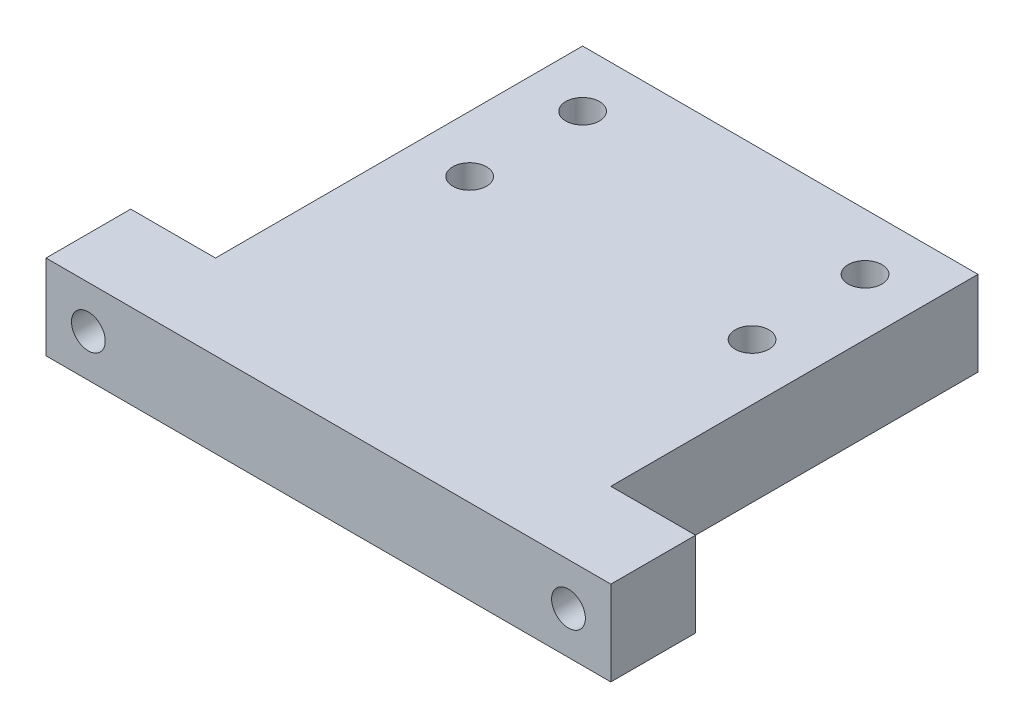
ISO-10303-21;
HEADER;
FILE_DESCRIPTION(('STEP AP214'),'2;1');
FILE_NAME('part.step','',(''),(''),'','','');
FILE_SCHEMA(('AUTOMOTIVE_DESIGN { 1 0 10303 214 1 1 1 1 }'));
ENDSEC;
DATA;
#1=APPLICATION_CONTEXT('core data for automotive mechanical design processes');
#2=APPLICATION_PROTOCOL_DEFINITION('international standard','automotive_design',2000,#1);
#3=PRODUCT_CONTEXT('',#1,'mechanical');
#4=PRODUCT('Part','Part','',(#3));
#5=PRODUCT_RELATED_PRODUCT_CATEGORY('part','',(#4));
#6=PRODUCT_DEFINITION_FORMATION('','',#4);
#7=PRODUCT_DEFINITION_CONTEXT('part definition',#1,'design');
#8=PRODUCT_DEFINITION('design','',#6,#7);
#9=PRODUCT_DEFINITION_SHAPE('','',#8);
#10=(LENGTH_UNIT() NAMED_UNIT(*) SI_UNIT(.MILLI.,.METRE.));
#11=(NAMED_UNIT(*) PLANE_ANGLE_UNIT() SI_UNIT($,.RADIAN.));
#12=(NAMED_UNIT(*) SI_UNIT($,.STERADIAN.) SOLID_ANGLE_UNIT());
#13=UNCERTAINTY_MEASURE_WITH_UNIT(LENGTH_MEASURE(1.E-05),#10,'distance_accuracy_value','');
#14=(GEOMETRIC_REPRESENTATION_CONTEXT(3) GLOBAL_UNCERTAINTY_ASSIGNED_CONTEXT((#13)) GLOBAL_UNIT_ASSIGNED_CONTEXT((#10,
#11,#12)) REPRESENTATION_CONTEXT('',''));
#15=CARTESIAN_POINT('',(0.,0.,0.));
#16=DIRECTION('',(0.,0.,1.));
#17=DIRECTION('',(1.,0.,0.));
#18=AXIS2_PLACEMENT_3D('',#15,#16,#17);
#19=CARTESIAN_POINT('',(-31.75,-4.7625,0.));
#20=DIRECTION('',(0.,-1.,0.));
#21=DIRECTION('',(0.,0.,-1.));
#22=AXIS2_PLACEMENT_3D('',#19,#20,#21);
#23=PLANE('',#22);
#24=CARTESIAN_POINT('',(-15.875,-4.7625,-44.45));
#25=DIRECTION('',(0.,1.,0.));
#26=DIRECTION('',(0.,0.,1.));
#27=AXIS2_PLACEMENT_3D('',#24,#25,#26);
#28=CIRCLE('',#27,1.89865);
#29=CARTESIAN_POINT('',(-15.875,-4.7625,-42.55135));
#30=VERTEX_POINT('',#29);
#31=EDGE_CURVE('E235',#30,#30,#28,.T.);
#32=ORIENTED_EDGE('',*,*,#31,.T.);
#33=EDGE_LOOP('',(#32));
#34=FACE_BOUND('',#33,.T.);
#35=CARTESIAN_POINT('',(-15.875,-4.7625,-31.75));
#36=DIRECTION('',(0.,1.,0.));
#37=DIRECTION('',(0.,0.,1.));
#38=AXIS2_PLACEMENT_3D('',#35,#36,#37);
#39=CIRCLE('',#38,1.89865);
#40=CARTESIAN_POINT('',(-15.875,-4.7625,-29.85135));
#41=VERTEX_POINT('',#40);
#42=EDGE_CURVE('E249',#41,#41,#39,.T.);
#43=ORIENTED_EDGE('',*,*,#42,.T.);
#44=EDGE_LOOP('',(#43));
#45=FACE_BOUND('',#44,.T.);
#46=DIRECTION('',(0.,0.,1.));
#47=VECTOR('',#46,1.);
#48=CARTESIAN_POINT('',(-31.75,-4.7625,0.));
#49=LINE('',#48,#47);
#50=CARTESIAN_POINT('',(-31.75,-4.7625,-9.525));
#51=VERTEX_POINT('',#50);
#52=CARTESIAN_POINT('',(-31.75,-4.7625,0.));
#53=VERTEX_POINT('',#52);
#54=EDGE_CURVE('E98',#51,#53,#49,.T.);
#55=ORIENTED_EDGE('',*,*,#54,.F.);
#56=DIRECTION('',(-1.,0.,0.));
#57=VECTOR('',#56,1.);
#58=CARTESIAN_POINT('',(-31.75,-4.7625,-9.525));
#59=LINE('',#58,#57);
#60=CARTESIAN_POINT('',(-22.225,-4.7625,-9.52499999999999));
#61=VERTEX_POINT('',#60);
#62=EDGE_CURVE('E128',#61,#51,#59,.T.);
#63=ORIENTED_EDGE('',*,*,#62,.F.);
#64=DIRECTION('',(0.,0.,1.));
#65=VECTOR('',#64,1.);
#66=CARTESIAN_POINT('',(-22.225,-4.7625,-50.8));
#67=LINE('',#66,#65);
#68=CARTESIAN_POINT('',(-22.225,-4.7625,-50.8));
#69=VERTEX_POINT('',#68);
#70=EDGE_CURVE('E126',#69,#61,#67,.T.);
#71=ORIENTED_EDGE('',*,*,#70,.F.);
#72=DIRECTION('',(-1.,0.,0.));
#73=VECTOR('',#72,1.);
#74=CARTESIAN_POINT('',(-22.225,-4.7625,-50.8));
#75=LINE('',#74,#73);
#76=CARTESIAN_POINT('',(22.225,-4.7625,-50.8));
#77=VERTEX_POINT('',#76);
#78=EDGE_CURVE('E124',#77,#69,#75,.T.);
#79=ORIENTED_EDGE('',*,*,#78,.F.);
#80=DIRECTION('',(0.,0.,-1.));
#81=VECTOR('',#80,1.);
#82=CARTESIAN_POINT('',(22.225,-4.7625,-50.8));
#83=LINE('',#82,#81);
#84=CARTESIAN_POINT('',(22.225,-4.7625,-9.525));
#85=VERTEX_POINT('',#84);
#86=EDGE_CURVE('E122',#85,#77,#83,.T.);
#87=ORIENTED_EDGE('',*,*,#86,.F.);
#88=DIRECTION('',(-1.,0.,0.));
#89=VECTOR('',#88,1.);
#90=CARTESIAN_POINT('',(31.75,-4.7625,-9.525));
#91=LINE('',#90,#89);
#92=CARTESIAN_POINT('',(31.75,-4.7625,-9.525));
#93=VERTEX_POINT('',#92);
#94=EDGE_CURVE('E120',#93,#85,#91,.T.);
#95=ORIENTED_EDGE('',*,*,#94,.F.);
#96=DIRECTION('',(0.,0.,-1.));
#97=VECTOR('',#96,1.);
#98=CARTESIAN_POINT('',(31.75,-4.7625,0.));
#99=LINE('',#98,#97);
#100=CARTESIAN_POINT('',(31.75,-4.7625,0.));
#101=VERTEX_POINT('',#100);
#102=EDGE_CURVE('E100',#101,#93,#99,.T.);
#103=ORIENTED_EDGE('',*,*,#102,.F.);
#104=DIRECTION('',(1.,0.,0.));
#105=VECTOR('',#104,1.);
#106=CARTESIAN_POINT('',(-31.75,-4.7625,0.));
#107=LINE('',#106,#105);
#108=EDGE_CURVE('E94',#53,#101,#107,.T.);
#109=ORIENTED_EDGE('',*,*,#108,.F.);
#110=EDGE_LOOP('',(#55,#63,#71,#79,#87,#95,#103,#109));
#111=FACE_BOUND('',#110,.T.);
#112=CARTESIAN_POINT('',(15.875,-4.7625,-31.75));
#113=DIRECTION('',(0.,1.,0.));
#114=DIRECTION('',(0.,0.,1.));
#115=AXIS2_PLACEMENT_3D('',#112,#113,#114);
#116=CIRCLE('',#115,1.89865);
#117=CARTESIAN_POINT('',(15.875,-4.7625,-29.85135));
#118=VERTEX_POINT('',#117);
#119=EDGE_CURVE('E243',#118,#118,#116,.T.);
#120=ORIENTED_EDGE('',*,*,#119,.T.);
#121=EDGE_LOOP('',(#120));
#122=FACE_BOUND('',#121,.T.);
#123=CARTESIAN_POINT('',(15.875,-4.7625,-44.45));
#124=DIRECTION('',(0.,1.,0.));
#125=DIRECTION('',(0.,0.,1.));
#126=AXIS2_PLACEMENT_3D('',#123,#124,#125);
#127=CIRCLE('',#126,1.89865);
#128=CARTESIAN_POINT('',(15.875,-4.7625,-42.55135));
#129=VERTEX_POINT('',#128);
#130=EDGE_CURVE('E231',#129,#129,#127,.T.);
#131=ORIENTED_EDGE('',*,*,#130,.T.);
#132=EDGE_LOOP('',(#131));
#133=FACE_BOUND('',#132,.T.);
#134=ADVANCED_FACE('F29',(#34,#45,#111,#122,#133),#23,.T.);
#135=CARTESIAN_POINT('',(-31.75,4.7625,0.));
#136=DIRECTION('',(1.,0.,0.));
#137=DIRECTION('',(0.,0.,-1.));
#138=AXIS2_PLACEMENT_3D('',#135,#136,#137);
#139=PLANE('',#138);
#140=ORIENTED_EDGE('',*,*,#54,.T.);
#141=DIRECTION('',(0.,-1.,0.));
#142=VECTOR('',#141,1.);
#143=CARTESIAN_POINT('',(-31.75,4.7625,0.));
#144=LINE('',#143,#142);
#145=CARTESIAN_POINT('',(-31.75,4.7625,0.));
#146=VERTEX_POINT('',#145);
#147=EDGE_CURVE('E11',#146,#53,#144,.T.);
#148=ORIENTED_EDGE('',*,*,#147,.F.);
#149=DIRECTION('',(0.,0.,1.));
#150=VECTOR('',#149,1.);
#151=CARTESIAN_POINT('',(-31.75,4.7625,0.));
#152=LINE('',#151,#150);
#153=CARTESIAN_POINT('',(-31.75,4.7625,-9.525));
#154=VERTEX_POINT('',#153);
#155=EDGE_CURVE('E130',#154,#146,#152,.T.);
#156=ORIENTED_EDGE('',*,*,#155,.F.);
#157=DIRECTION('',(0.,-1.,0.));
#158=VECTOR('',#157,1.);
#159=CARTESIAN_POINT('',(-31.75,4.7625,-9.525));
#160=LINE('',#159,#158);
#161=EDGE_CURVE('E111',#154,#51,#160,.T.);
#162=ORIENTED_EDGE('',*,*,#161,.T.);
#163=EDGE_LOOP('',(#140,#148,#156,#162));
#164=FACE_BOUND('',#163,.T.);
#165=ADVANCED_FACE('F31',(#164),#139,.F.);
#166=CARTESIAN_POINT('',(-31.75,4.7625,0.));
#167=DIRECTION('',(0.,0.,-1.));
#168=DIRECTION('',(-1.,0.,0.));
#169=AXIS2_PLACEMENT_3D('',#166,#167,#168);
#170=PLANE('',#169);
#171=CARTESIAN_POINT('',(26.9875,0.,0.));
#172=DIRECTION('',(0.,0.,-1.));
#173=DIRECTION('',(-1.,0.,0.));
#174=AXIS2_PLACEMENT_3D('',#171,#172,#173);
#175=CIRCLE('',#174,1.89865);
#176=CARTESIAN_POINT('',(25.08885,0.,0.));
#177=VERTEX_POINT('',#176);
#178=EDGE_CURVE('E255',#177,#177,#175,.T.);
#179=ORIENTED_EDGE('',*,*,#178,.T.);
#180=EDGE_LOOP('',(#179));
#181=FACE_BOUND('',#180,.T.);
#182=CARTESIAN_POINT('',(-26.9875,0.,0.));
#183=DIRECTION('',(0.,0.,-1.));
#184=DIRECTION('',(-1.,0.,0.));
#185=AXIS2_PLACEMENT_3D('',#182,#183,#184);
#186=CIRCLE('',#185,1.89865);
#187=CARTESIAN_POINT('',(-28.88615,0.,0.));
#188=VERTEX_POINT('',#187);
#189=EDGE_CURVE('E115',#188,#188,#186,.T.);
#190=ORIENTED_EDGE('',*,*,#189,.T.);
#191=EDGE_LOOP('',(#190));
#192=FACE_BOUND('',#191,.T.);
#193=ORIENTED_EDGE('',*,*,#108,.T.);
#194=DIRECTION('',(0.,-1.,0.));
#195=VECTOR('',#194,1.);
#196=CARTESIAN_POINT('',(31.75,4.7625,0.));
#197=LINE('',#196,#195);
#198=CARTESIAN_POINT('',(31.75,4.7625,0.));
#199=VERTEX_POINT('',#198);
#200=EDGE_CURVE('E37',#199,#101,#197,.T.);
#201=ORIENTED_EDGE('',*,*,#200,.F.);
#202=DIRECTION('',(1.,0.,0.));
#203=VECTOR('',#202,1.);
#204=CARTESIAN_POINT('',(-31.75,4.7625,0.));
#205=LINE('',#204,#203);
#206=EDGE_CURVE('E107',#146,#199,#205,.T.);
#207=ORIENTED_EDGE('',*,*,#206,.F.);
#208=ORIENTED_EDGE('',*,*,#147,.T.);
#209=EDGE_LOOP('',(#193,#201,#207,#208));
#210=FACE_BOUND('',#209,.T.);
#211=ADVANCED_FACE('F106',(#181,#192,#210),#170,.F.);
#212=CARTESIAN_POINT('',(31.75,4.7625,0.));
#213=DIRECTION('',(-1.,0.,0.));
#214=DIRECTION('',(0.,0.,1.));
#215=AXIS2_PLACEMENT_3D('',#212,#213,#214);
#216=PLANE('',#215);
#217=ORIENTED_EDGE('',*,*,#102,.T.);
#218=DIRECTION('',(0.,-1.,0.));
#219=VECTOR('',#218,1.);
#220=CARTESIAN_POINT('',(31.75,4.7625,-9.525));
#221=LINE('',#220,#219);
#222=CARTESIAN_POINT('',(31.75,4.7625,-9.525));
#223=VERTEX_POINT('',#222);
#224=EDGE_CURVE('E156',#223,#93,#221,.T.);
#225=ORIENTED_EDGE('',*,*,#224,.F.);
#226=DIRECTION('',(0.,0.,-1.));
#227=VECTOR('',#226,1.);
#228=CARTESIAN_POINT('',(31.75,4.7625,0.));
#229=LINE('',#228,#227);
#230=EDGE_CURVE('E133',#199,#223,#229,.T.);
#231=ORIENTED_EDGE('',*,*,#230,.F.);
#232=ORIENTED_EDGE('',*,*,#200,.T.);
#233=EDGE_LOOP('',(#217,#225,#231,#232));
#234=FACE_BOUND('',#233,.T.);
#235=ADVANCED_FACE('F160',(#234),#216,.F.);
#236=CARTESIAN_POINT('',(31.75,4.7625,-9.525));
#237=DIRECTION('',(0.,0.,1.));
#238=DIRECTION('',(1.,0.,0.));
#239=AXIS2_PLACEMENT_3D('',#236,#237,#238);
#240=PLANE('',#239);
#241=CARTESIAN_POINT('',(26.9875,0.,-9.525));
#242=DIRECTION('',(0.,0.,-1.));
#243=DIRECTION('',(-1.,0.,0.));
#244=AXIS2_PLACEMENT_3D('',#241,#242,#243);
#245=CIRCLE('',#244,1.89864999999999);
#246=CARTESIAN_POINT('',(25.08885,0.,-9.525));
#247=VERTEX_POINT('',#246);
#248=EDGE_CURVE('E258',#247,#247,#245,.T.);
#249=ORIENTED_EDGE('',*,*,#248,.F.);
#250=EDGE_LOOP('',(#249));
#251=FACE_BOUND('',#250,.T.);
#252=ORIENTED_EDGE('',*,*,#94,.T.);
#253=DIRECTION('',(0.,-1.,0.));
#254=VECTOR('',#253,1.);
#255=CARTESIAN_POINT('',(22.225,4.7625,-9.525));
#256=LINE('',#255,#254);
#257=CARTESIAN_POINT('',(22.225,4.7625,-9.525));
#258=VERTEX_POINT('',#257);
#259=EDGE_CURVE('E153',#258,#85,#256,.T.);
#260=ORIENTED_EDGE('',*,*,#259,.F.);
#261=DIRECTION('',(-1.,0.,0.));
#262=VECTOR('',#261,1.);
#263=CARTESIAN_POINT('',(31.75,4.7625,-9.525));
#264=LINE('',#263,#262);
#265=EDGE_CURVE('E135',#223,#258,#264,.T.);
#266=ORIENTED_EDGE('',*,*,#265,.F.);
#267=ORIENTED_EDGE('',*,*,#224,.T.);
#268=EDGE_LOOP('',(#252,#260,#266,#267));
#269=FACE_BOUND('',#268,.T.);
#270=ADVANCED_FACE('F168',(#251,#269),#240,.F.);
#271=CARTESIAN_POINT('',(22.225,4.7625,-50.8));
#272=DIRECTION('',(-1.,0.,0.));
#273=DIRECTION('',(0.,0.,1.));
#274=AXIS2_PLACEMENT_3D('',#271,#272,#273);
#275=PLANE('',#274);
#276=ORIENTED_EDGE('',*,*,#86,.T.);
#277=DIRECTION('',(0.,-1.,0.));
#278=VECTOR('',#277,1.);
#279=CARTESIAN_POINT('',(22.225,4.7625,-50.8));
#280=LINE('',#279,#278);
#281=CARTESIAN_POINT('',(22.225,4.7625,-50.8));
#282=VERTEX_POINT('',#281);
#283=EDGE_CURVE('E150',#282,#77,#280,.T.);
#284=ORIENTED_EDGE('',*,*,#283,.F.);
#285=DIRECTION('',(0.,0.,-1.));
#286=VECTOR('',#285,1.);
#287=CARTESIAN_POINT('',(22.225,4.7625,-50.8));
#288=LINE('',#287,#286);
#289=EDGE_CURVE('E137',#258,#282,#288,.T.);
#290=ORIENTED_EDGE('',*,*,#289,.F.);
#291=ORIENTED_EDGE('',*,*,#259,.T.);
#292=EDGE_LOOP('',(#276,#284,#290,#291));
#293=FACE_BOUND('',#292,.T.);
#294=ADVANCED_FACE('F171',(#293),#275,.F.);
#295=CARTESIAN_POINT('',(-22.225,4.7625,-50.8));
#296=DIRECTION('',(0.,0.,1.));
#297=DIRECTION('',(1.,0.,0.));
#298=AXIS2_PLACEMENT_3D('',#295,#296,#297);
#299=PLANE('',#298);
#300=ORIENTED_EDGE('',*,*,#78,.T.);
#301=DIRECTION('',(0.,-1.,0.));
#302=VECTOR('',#301,1.);
#303=CARTESIAN_POINT('',(-22.225,4.7625,-50.8));
#304=LINE('',#303,#302);
#305=CARTESIAN_POINT('',(-22.225,4.7625,-50.8));
#306=VERTEX_POINT('',#305);
#307=EDGE_CURVE('E147',#306,#69,#304,.T.);
#308=ORIENTED_EDGE('',*,*,#307,.F.);
#309=DIRECTION('',(-1.,0.,0.));
#310=VECTOR('',#309,1.);
#311=CARTESIAN_POINT('',(-22.225,4.7625,-50.8));
#312=LINE('',#311,#310);
#313=EDGE_CURVE('E139',#282,#306,#312,.T.);
#314=ORIENTED_EDGE('',*,*,#313,.F.);
#315=ORIENTED_EDGE('',*,*,#283,.T.);
#316=EDGE_LOOP('',(#300,#308,#314,#315));
#317=FACE_BOUND('',#316,.T.);
#318=ADVANCED_FACE('F176',(#317),#299,.F.);
#319=CARTESIAN_POINT('',(-22.225,4.7625,-50.8));
#320=DIRECTION('',(1.,0.,0.));
#321=DIRECTION('',(0.,0.,-1.));
#322=AXIS2_PLACEMENT_3D('',#319,#320,#321);
#323=PLANE('',#322);
#324=ORIENTED_EDGE('',*,*,#70,.T.);
#325=DIRECTION('',(0.,-1.,0.));
#326=VECTOR('',#325,1.);
#327=CARTESIAN_POINT('',(-22.225,4.7625,-9.52499999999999));
#328=LINE('',#327,#326);
#329=CARTESIAN_POINT('',(-22.225,4.7625,-9.52499999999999));
#330=VERTEX_POINT('',#329);
#331=EDGE_CURVE('E144',#330,#61,#328,.T.);
#332=ORIENTED_EDGE('',*,*,#331,.F.);
#333=DIRECTION('',(0.,0.,1.));
#334=VECTOR('',#333,1.);
#335=CARTESIAN_POINT('',(-22.225,4.7625,-50.8));
#336=LINE('',#335,#334);
#337=EDGE_CURVE('E49',#306,#330,#336,.T.);
#338=ORIENTED_EDGE('',*,*,#337,.F.);
#339=ORIENTED_EDGE('',*,*,#307,.T.);
#340=EDGE_LOOP('',(#324,#332,#338,#339));
#341=FACE_BOUND('',#340,.T.);
#342=ADVANCED_FACE('F179',(#341),#323,.F.);
#343=CARTESIAN_POINT('',(-31.75,4.7625,-9.525));
#344=DIRECTION('',(0.,0.,1.));
#345=DIRECTION('',(1.,0.,0.));
#346=AXIS2_PLACEMENT_3D('',#343,#344,#345);
#347=PLANE('',#346);
#348=CARTESIAN_POINT('',(-26.9875,0.,-9.52499999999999));
#349=DIRECTION('',(0.,0.,-1.));
#350=DIRECTION('',(-1.,0.,0.));
#351=AXIS2_PLACEMENT_3D('',#348,#349,#350);
#352=CIRCLE('',#351,1.89864999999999);
#353=CARTESIAN_POINT('',(-28.88615,0.,-9.52499999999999));
#354=VERTEX_POINT('',#353);
#355=EDGE_CURVE('E112',#354,#354,#352,.T.);
#356=ORIENTED_EDGE('',*,*,#355,.F.);
#357=EDGE_LOOP('',(#356));
#358=FACE_BOUND('',#357,.T.);
#359=ORIENTED_EDGE('',*,*,#62,.T.);
#360=ORIENTED_EDGE('',*,*,#161,.F.);
#361=DIRECTION('',(-1.,0.,0.));
#362=VECTOR('',#361,1.);
#363=CARTESIAN_POINT('',(-31.75,4.7625,-9.525));
#364=LINE('',#363,#362);
#365=EDGE_CURVE('E44',#330,#154,#364,.T.);
#366=ORIENTED_EDGE('',*,*,#365,.F.);
#367=ORIENTED_EDGE('',*,*,#331,.T.);
#368=EDGE_LOOP('',(#359,#360,#366,#367));
#369=FACE_BOUND('',#368,.T.);
#370=ADVANCED_FACE('F181',(#358,#369),#347,.F.);
#371=CARTESIAN_POINT('',(-31.75,4.7625,0.));
#372=DIRECTION('',(0.,-1.,0.));
#373=DIRECTION('',(0.,0.,-1.));
#374=AXIS2_PLACEMENT_3D('',#371,#372,#373);
#375=PLANE('',#374);
#376=CARTESIAN_POINT('',(15.875,4.7625,-44.45));
#377=DIRECTION('',(0.,1.,0.));
#378=DIRECTION('',(0.,0.,1.));
#379=AXIS2_PLACEMENT_3D('',#376,#377,#378);
#380=CIRCLE('',#379,1.89864999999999);
#381=CARTESIAN_POINT('',(15.875,4.7625,-42.55135));
#382=VERTEX_POINT('',#381);
#383=EDGE_CURVE('E234',#382,#382,#380,.T.);
#384=ORIENTED_EDGE('',*,*,#383,.F.);
#385=EDGE_LOOP('',(#384));
#386=FACE_BOUND('',#385,.T.);
#387=CARTESIAN_POINT('',(-15.875,4.7625,-44.45));
#388=DIRECTION('',(0.,1.,0.));
#389=DIRECTION('',(0.,0.,1.));
#390=AXIS2_PLACEMENT_3D('',#387,#388,#389);
#391=CIRCLE('',#390,1.89864999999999);
#392=CARTESIAN_POINT('',(-15.875,4.7625,-42.55135));
#393=VERTEX_POINT('',#392);
#394=EDGE_CURVE('E237',#393,#393,#391,.T.);
#395=ORIENTED_EDGE('',*,*,#394,.F.);
#396=EDGE_LOOP('',(#395));
#397=FACE_BOUND('',#396,.T.);
#398=CARTESIAN_POINT('',(15.875,4.7625,-31.75));
#399=DIRECTION('',(0.,1.,0.));
#400=DIRECTION('',(0.,0.,1.));
#401=AXIS2_PLACEMENT_3D('',#398,#399,#400);
#402=CIRCLE('',#401,1.89864999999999);
#403=CARTESIAN_POINT('',(15.875,4.7625,-29.85135));
#404=VERTEX_POINT('',#403);
#405=EDGE_CURVE('E246',#404,#404,#402,.T.);
#406=ORIENTED_EDGE('',*,*,#405,.F.);
#407=EDGE_LOOP('',(#406));
#408=FACE_BOUND('',#407,.T.);
#409=CARTESIAN_POINT('',(-15.875,4.7625,-31.75));
#410=DIRECTION('',(0.,1.,0.));
#411=DIRECTION('',(0.,0.,1.));
#412=AXIS2_PLACEMENT_3D('',#409,#410,#411);
#413=CIRCLE('',#412,1.89864999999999);
#414=CARTESIAN_POINT('',(-15.875,4.7625,-29.85135));
#415=VERTEX_POINT('',#414);
#416=EDGE_CURVE('E252',#415,#415,#413,.T.);
#417=ORIENTED_EDGE('',*,*,#416,.F.);
#418=EDGE_LOOP('',(#417));
#419=FACE_BOUND('',#418,.T.);
#420=ORIENTED_EDGE('',*,*,#155,.T.);
#421=ORIENTED_EDGE('',*,*,#206,.T.);
#422=ORIENTED_EDGE('',*,*,#230,.T.);
#423=ORIENTED_EDGE('',*,*,#265,.T.);
#424=ORIENTED_EDGE('',*,*,#289,.T.);
#425=ORIENTED_EDGE('',*,*,#313,.T.);
#426=ORIENTED_EDGE('',*,*,#337,.T.);
#427=ORIENTED_EDGE('',*,*,#365,.T.);
#428=EDGE_LOOP('',(#420,#421,#422,#423,#424,#425,#426,#427));
#429=FACE_BOUND('',#428,.T.);
#430=ADVANCED_FACE('F163',(#386,#397,#408,#419,#429),#375,.F.);
#431=CARTESIAN_POINT('',(-26.9875,0.,-9.52499999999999));
#432=DIRECTION('',(0.,0.,-1.));
#433=DIRECTION('',(-1.,0.,0.));
#434=AXIS2_PLACEMENT_3D('',#431,#432,#433);
#435=CYLINDRICAL_SURFACE('',#434,1.89864999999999);
#436=ORIENTED_EDGE('',*,*,#189,.F.);
#437=EDGE_LOOP('',(#436));
#438=FACE_BOUND('',#437,.T.);
#439=ORIENTED_EDGE('',*,*,#355,.T.);
#440=EDGE_LOOP('',(#439));
#441=FACE_BOUND('',#440,.T.);
#442=ADVANCED_FACE('F190',(#438,#441),#435,.F.);
#443=CARTESIAN_POINT('',(26.9875,0.,-9.525));
#444=DIRECTION('',(0.,0.,-1.));
#445=DIRECTION('',(-1.,0.,0.));
#446=AXIS2_PLACEMENT_3D('',#443,#444,#445);
#447=CYLINDRICAL_SURFACE('',#446,1.89864999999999);
#448=ORIENTED_EDGE('',*,*,#178,.F.);
#449=EDGE_LOOP('',(#448));
#450=FACE_BOUND('',#449,.T.);
#451=ORIENTED_EDGE('',*,*,#248,.T.);
#452=EDGE_LOOP('',(#451));
#453=FACE_BOUND('',#452,.T.);
#454=ADVANCED_FACE('F207',(#450,#453),#447,.F.);
#455=CARTESIAN_POINT('',(-15.875,4.7625,-31.75));
#456=DIRECTION('',(0.,1.,0.));
#457=DIRECTION('',(0.,0.,1.));
#458=AXIS2_PLACEMENT_3D('',#455,#456,#457);
#459=CYLINDRICAL_SURFACE('',#458,1.89864999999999);
#460=ORIENTED_EDGE('',*,*,#42,.F.);
#461=EDGE_LOOP('',(#460));
#462=FACE_BOUND('',#461,.T.);
#463=ORIENTED_EDGE('',*,*,#416,.T.);
#464=EDGE_LOOP('',(#463));
#465=FACE_BOUND('',#464,.T.);
#466=ADVANCED_FACE('F210',(#462,#465),#459,.F.);
#467=CARTESIAN_POINT('',(15.875,4.7625,-31.75));
#468=DIRECTION('',(0.,1.,0.));
#469=DIRECTION('',(0.,0.,1.));
#470=AXIS2_PLACEMENT_3D('',#467,#468,#469);
#471=CYLINDRICAL_SURFACE('',#470,1.89864999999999);
#472=ORIENTED_EDGE('',*,*,#119,.F.);
#473=EDGE_LOOP('',(#472));
#474=FACE_BOUND('',#473,.T.);
#475=ORIENTED_EDGE('',*,*,#405,.T.);
#476=EDGE_LOOP('',(#475));
#477=FACE_BOUND('',#476,.T.);
#478=ADVANCED_FACE('F214',(#474,#477),#471,.F.);
#479=CARTESIAN_POINT('',(-15.875,4.7625,-44.45));
#480=DIRECTION('',(0.,1.,0.));
#481=DIRECTION('',(0.,0.,1.));
#482=AXIS2_PLACEMENT_3D('',#479,#480,#481);
#483=CYLINDRICAL_SURFACE('',#482,1.89864999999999);
#484=ORIENTED_EDGE('',*,*,#31,.F.);
#485=EDGE_LOOP('',(#484));
#486=FACE_BOUND('',#485,.T.);
#487=ORIENTED_EDGE('',*,*,#394,.T.);
#488=EDGE_LOOP('',(#487));
#489=FACE_BOUND('',#488,.T.);
#490=ADVANCED_FACE('F218',(#486,#489),#483,.F.);
#491=CARTESIAN_POINT('',(15.875,4.7625,-44.45));
#492=DIRECTION('',(0.,1.,0.));
#493=DIRECTION('',(0.,0.,1.));
#494=AXIS2_PLACEMENT_3D('',#491,#492,#493);
#495=CYLINDRICAL_SURFACE('',#494,1.89864999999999);
#496=ORIENTED_EDGE('',*,*,#130,.F.);
#497=EDGE_LOOP('',(#496));
#498=FACE_BOUND('',#497,.T.);
#499=ORIENTED_EDGE('',*,*,#383,.T.);
#500=EDGE_LOOP('',(#499));
#501=FACE_BOUND('',#500,.T.);
#502=ADVANCED_FACE('F222',(#498,#501),#495,.F.);
#503=CLOSED_SHELL('',(#134,#165,#211,#235,#270,#294,#318,#342,#370,#430,#442,#454,#466,#478,
#490,#502));
#504=MANIFOLD_SOLID_BREP('B2',#503);
#505=ADVANCED_BREP_SHAPE_REPRESENTATION('',(#18,#504),#14);
#506=SHAPE_DEFINITION_REPRESENTATION(#9,#505);
ENDSEC;
END-ISO-10303-21;
